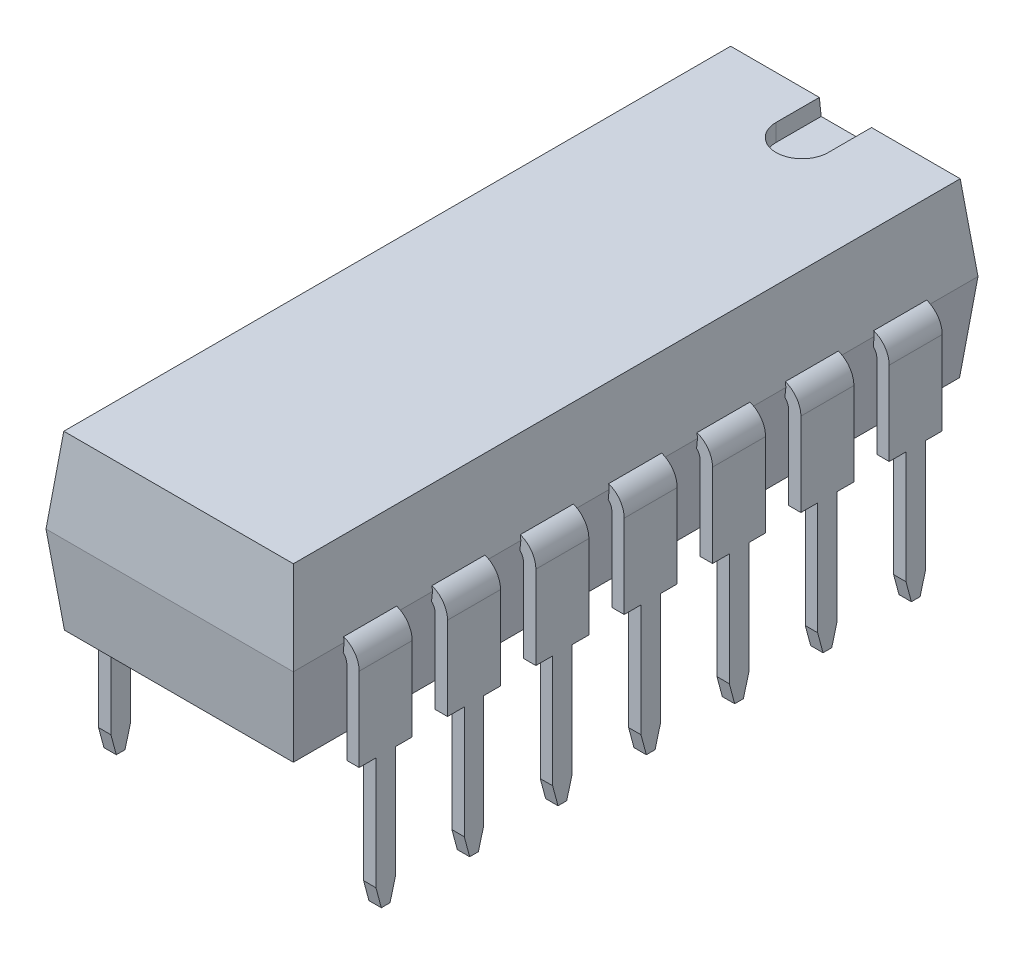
from build123d import *

# Parameters (mm, degrees)
EXTRUDE_1_DEPTH           = 0.762
CUT_EXTRUDE_1_DEPTH       = 13.181306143
SKETCH_1_W                = 7.112
SKETCH_1_H                = 19.685
EXTRUDE_2_DEPTH           = 2.434
EXTRUDE_2_TAPER           = 6
EXTRUDE_2_OTHER_WAY_DEPTH = 2.519
EXTRUDE_2_OTHER_WAY_TAPER = 6
CUT_EXTRUDE_2_DEPTH       = 0.5
PATTERN_LINEAR_1_COUNT    = 7
PATTERN_LINEAR_1_PITCH    = 2.54


with BuildPart() as part:
    # Sketch 10 → Extrude 1 (new, symmetric)
    with BuildSketch(Plane.XY.offset(-7.62)):
        with BuildLine():
            Line((-3.6322, -3.81), (-3.6322, 2.4))
            ThreePointArc((-3.6322, 2.4), (-3.537829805, 2.627829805), (-3.31, 2.7222))
            Line((-3.31, 2.7222), (3.31, 2.7222))
            ThreePointArc((3.31, 2.7222), (3.537829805, 2.627829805), (3.6322, 2.4))
            Line((3.6322, 2.4), (3.6322, -3.81))
            Line((3.6322, -3.81), (3.9878, -3.81))
            Line((3.9878, -3.81), (3.9878, 2.4))
            ThreePointArc((3.9878, 2.4), (3.789276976, 2.879276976), (3.31, 3.0778))
            Line((3.31, 3.0778), (-3.31, 3.0778))
            ThreePointArc((-3.31, 3.0778), (-3.789276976, 2.879276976), (-3.9878, 2.4))
            Line((-3.9878, 2.4), (-3.9878, -3.81))
            Line((-3.9878, -3.81), (-3.6322, -3.81))
        make_face()
    extrude_1 = extrude(amount=EXTRUDE_1_DEPTH, both=True)

    # Sketch 11 → Cut-Extrude 1 (cut, through all)
    with BuildSketch(Plane(origin=(3.9878, 0, 0), x_dir=(0, 0, -1), z_dir=(1, 0, 0))):
        Polygon((6.858, 0), (7.3406, 0), (7.3406, -3.233771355), (7.495, -3.81), (6.858, -3.81), align=None)
        Polygon((8.382, -3.81), (8.382, 0), (7.8994, 0), (7.8994, -3.233771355), (7.745, -3.81), align=None)
    cut_extrude_1 = extrude(amount=-CUT_EXTRUDE_1_DEPTH, mode=Mode.SUBTRACT)

    # Sketch 1 → Extrude 2 (add)
    with BuildSketch(Plane(origin=(0, 2.9, 0), x_dir=(1, 0, 0), z_dir=(0, 1, 0))):
        Rectangle(SKETCH_1_W, SKETCH_1_H)
    extrude(amount=EXTRUDE_2_DEPTH, taper=EXTRUDE_2_TAPER)

    # Sketch 1 → Extrude 2 other way (add)
    with BuildSketch(Plane(origin=(0, 2.9, 0), x_dir=(1, 0, 0), z_dir=(0, 1, 0))):
        Rectangle(SKETCH_1_W, SKETCH_1_H)
    extrude(amount=-EXTRUDE_2_OTHER_WAY_DEPTH, taper=EXTRUDE_2_OTHER_WAY_TAPER)

    # Sketch 12 → Cut-Extrude 2 (cut)
    with BuildSketch(Plane(origin=(0, 5.334, 0), x_dir=(-1, 0, 0), z_dir=(0, 1, 0))):
        with BuildLine():
            Line((0.75, -9.8425), (0.75, -8.3425))
            ThreePointArc((0.75, -8.3425), (0, -7.5925), (-0.75, -8.3425))
            Line((-0.75, -8.3425), (-0.75, -9.8425))
            Line((-0.75, -9.8425), (0.75, -9.8425))
        make_face()
    extrude(amount=-CUT_EXTRUDE_2_DEPTH, mode=Mode.SUBTRACT)

    # Pattern Linear 1: Extrude 1, Cut-Extrude 1 ×7
    with Locations(*[(0, 0, i * PATTERN_LINEAR_1_PITCH) for i in range(1, PATTERN_LINEAR_1_COUNT)]):
        add(extrude_1)
        add(cut_extrude_1, mode=Mode.SUBTRACT)


solid = part.part
